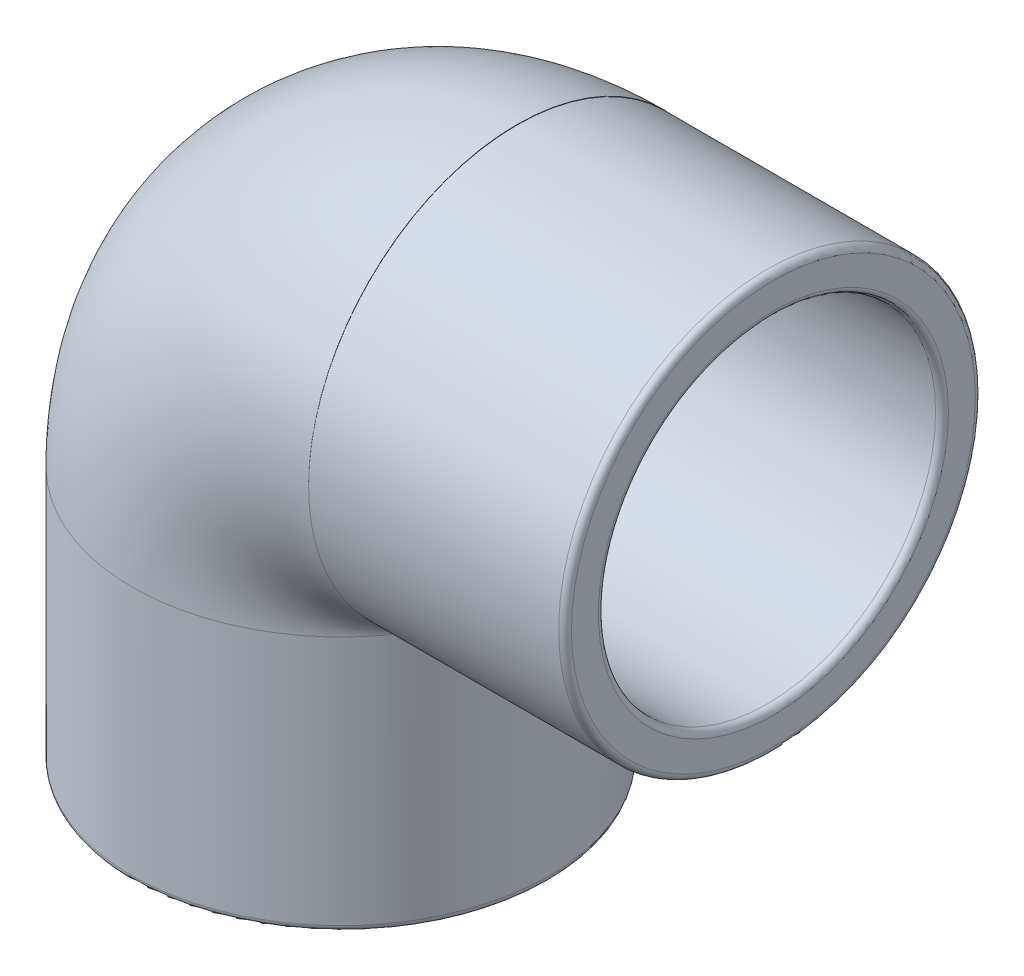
ISO-10303-21;
HEADER;
FILE_DESCRIPTION(('STEP AP214'),'2;1');
FILE_NAME('part.step','',(''),(''),'','','');
FILE_SCHEMA(('AUTOMOTIVE_DESIGN { 1 0 10303 214 1 1 1 1 }'));
ENDSEC;
DATA;
#1=APPLICATION_CONTEXT('core data for automotive mechanical design processes');
#2=APPLICATION_PROTOCOL_DEFINITION('international standard','automotive_design',2000,#1);
#3=PRODUCT_CONTEXT('',#1,'mechanical');
#4=PRODUCT('Part','Part','',(#3));
#5=PRODUCT_RELATED_PRODUCT_CATEGORY('part','',(#4));
#6=PRODUCT_DEFINITION_FORMATION('','',#4);
#7=PRODUCT_DEFINITION_CONTEXT('part definition',#1,'design');
#8=PRODUCT_DEFINITION('design','',#6,#7);
#9=PRODUCT_DEFINITION_SHAPE('','',#8);
#10=(LENGTH_UNIT() NAMED_UNIT(*) SI_UNIT(.MILLI.,.METRE.));
#11=(NAMED_UNIT(*) PLANE_ANGLE_UNIT() SI_UNIT($,.RADIAN.));
#12=(NAMED_UNIT(*) SI_UNIT($,.STERADIAN.) SOLID_ANGLE_UNIT());
#13=UNCERTAINTY_MEASURE_WITH_UNIT(LENGTH_MEASURE(1.E-05),#10,'distance_accuracy_value','');
#14=(GEOMETRIC_REPRESENTATION_CONTEXT(3) GLOBAL_UNCERTAINTY_ASSIGNED_CONTEXT((#13)) GLOBAL_UNIT_ASSIGNED_CONTEXT((#10,
#11,#12)) REPRESENTATION_CONTEXT('',''));
#15=CARTESIAN_POINT('',(0.,0.,0.));
#16=DIRECTION('',(0.,0.,1.));
#17=DIRECTION('',(1.,0.,0.));
#18=AXIS2_PLACEMENT_3D('',#15,#16,#17);
#19=CARTESIAN_POINT('',(0.,17.4254660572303,0.));
#20=DIRECTION('',(1.,0.,0.));
#21=DIRECTION('',(0.,0.,-1.));
#22=AXIS2_PLACEMENT_3D('',#19,#20,#21);
#23=PLANE('',#22);
#24=CARTESIAN_POINT('',(0.,17.4635017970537,0.));
#25=DIRECTION('',(1.,0.,0.));
#26=DIRECTION('',(0.,1.,0.));
#27=AXIS2_PLACEMENT_3D('',#24,#25,#26);
#28=CIRCLE('',#27,20.6375);
#29=CARTESIAN_POINT('',(0.,17.4444839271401,20.637491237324));
#30=VERTEX_POINT('',#29);
#31=CARTESIAN_POINT('',(0.,0.,10.9969319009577));
#32=VERTEX_POINT('',#31);
#33=EDGE_CURVE('E82',#30,#32,#28,.T.);
#34=ORIENTED_EDGE('',*,*,#33,.T.);
#35=DIRECTION('',(0.,-1.,0.));
#36=VECTOR('',#35,1.);
#37=CARTESIAN_POINT('',(0.,0.,10.9969319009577));
#38=LINE('',#37,#36);
#39=CARTESIAN_POINT('',(0.,-0.0380357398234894,10.9969319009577));
#40=VERTEX_POINT('',#39);
#41=EDGE_CURVE('E94',#32,#40,#38,.T.);
#42=ORIENTED_EDGE('',*,*,#41,.T.);
#43=CARTESIAN_POINT('',(0.,17.4254660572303,0.));
#44=DIRECTION('',(1.,0.,0.));
#45=DIRECTION('',(0.,0.,-1.));
#46=AXIS2_PLACEMENT_3D('',#43,#44,#45);
#47=CIRCLE('',#46,20.6375);
#48=EDGE_CURVE('E63',#30,#40,#47,.T.);
#49=ORIENTED_EDGE('',*,*,#48,.F.);
#50=EDGE_LOOP('',(#34,#42,#49));
#51=FACE_BOUND('',#50,.T.);
#52=ADVANCED_FACE('F42',(#51),#23,.F.);
#53=CARTESIAN_POINT('',(0.,0.,-10.9969319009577));
#54=VERTEX_POINT('',#53);
#55=CARTESIAN_POINT('',(0.,17.4444839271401,-20.637491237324));
#56=VERTEX_POINT('',#55);
#57=EDGE_CURVE('E85',#54,#56,#28,.T.);
#58=ORIENTED_EDGE('',*,*,#57,.T.);
#59=CARTESIAN_POINT('',(0.,-0.0380357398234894,-10.9969319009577));
#60=VERTEX_POINT('',#59);
#61=EDGE_CURVE('E109',#60,#56,#47,.T.);
#62=ORIENTED_EDGE('',*,*,#61,.F.);
#63=DIRECTION('',(0.,-1.,0.));
#64=VECTOR('',#63,1.);
#65=CARTESIAN_POINT('',(0.,0.,-10.9969319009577));
#66=LINE('',#65,#64);
#67=EDGE_CURVE('E102',#60,#54,#66,.F.);
#68=ORIENTED_EDGE('',*,*,#67,.T.);
#69=EDGE_LOOP('',(#58,#62,#68));
#70=FACE_BOUND('',#69,.T.);
#71=ADVANCED_FACE('F157',(#70),#23,.F.);
#72=CARTESIAN_POINT('',(0.,17.4254660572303,0.));
#73=DIRECTION('',(1.,0.,0.));
#74=DIRECTION('',(0.,0.,-1.));
#75=AXIS2_PLACEMENT_3D('',#72,#73,#74);
#76=CYLINDRICAL_SURFACE('',#75,20.6375);
#77=CARTESIAN_POINT('',(24.765,17.4254660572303,0.));
#78=DIRECTION('',(1.,0.,0.));
#79=DIRECTION('',(0.,0.,-1.));
#80=AXIS2_PLACEMENT_3D('',#77,#78,#79);
#81=CIRCLE('',#80,20.6375);
#82=CARTESIAN_POINT('',(24.765,17.4254660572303,-20.6375));
#83=VERTEX_POINT('',#82);
#84=EDGE_CURVE('E11',#83,#83,#81,.F.);
#85=ORIENTED_EDGE('',*,*,#84,.T.);
#86=EDGE_LOOP('',(#85));
#87=FACE_BOUND('',#86,.T.);
#88=CARTESIAN_POINT('',(-17.4635017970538,17.4254660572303,0.));
#89=DIRECTION('',(0.707106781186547,0.707106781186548,0.));
#90=DIRECTION('',(0.707106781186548,-0.707106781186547,0.));
#91=AXIS2_PLACEMENT_3D('',#88,#89,#90);
#92=ELLIPSE('',#91,29.1858323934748,20.6375);
#93=EDGE_CURVE('E58',#60,#40,#92,.F.);
#94=ORIENTED_EDGE('',*,*,#93,.F.);
#95=ORIENTED_EDGE('',*,*,#61,.T.);
#96=CARTESIAN_POINT('',(0.,17.4254660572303,0.));
#97=DIRECTION('',(1.,0.,0.));
#98=DIRECTION('',(0.,1.,0.));
#99=AXIS2_PLACEMENT_3D('',#96,#97,#98);
#100=CIRCLE('',#99,20.6375);
#101=EDGE_CURVE('E91',#30,#56,#100,.F.);
#102=ORIENTED_EDGE('',*,*,#101,.F.);
#103=ORIENTED_EDGE('',*,*,#48,.T.);
#104=EDGE_LOOP('',(#94,#95,#102,#103));
#105=FACE_BOUND('',#104,.T.);
#106=ADVANCED_FACE('F162',(#87,#105),#76,.T.);
#107=CARTESIAN_POINT('',(25.4,17.4254660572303,0.));
#108=DIRECTION('',(1.,0.,0.));
#109=DIRECTION('',(0.,0.,-1.));
#110=AXIS2_PLACEMENT_3D('',#107,#108,#109);
#111=PLANE('',#110);
#112=CARTESIAN_POINT('',(25.4,17.4635017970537,0.));
#113=DIRECTION('',(1.,0.,0.));
#114=DIRECTION('',(0.,0.,-1.));
#115=AXIS2_PLACEMENT_3D('',#112,#113,#114);
#116=CIRCLE('',#115,17.3355);
#117=CARTESIAN_POINT('',(25.4,17.4635017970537,-17.3355));
#118=VERTEX_POINT('',#117);
#119=EDGE_CURVE('E128',#118,#118,#116,.F.);
#120=ORIENTED_EDGE('',*,*,#119,.T.);
#121=EDGE_LOOP('',(#120));
#122=FACE_BOUND('',#121,.T.);
#123=CARTESIAN_POINT('',(25.4,17.4254660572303,0.));
#124=DIRECTION('',(1.,0.,0.));
#125=DIRECTION('',(0.,0.,-1.));
#126=AXIS2_PLACEMENT_3D('',#123,#124,#125);
#127=CIRCLE('',#126,20.0025);
#128=CARTESIAN_POINT('',(25.4,17.4254660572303,-20.0025));
#129=VERTEX_POINT('',#128);
#130=EDGE_CURVE('E124',#129,#129,#127,.T.);
#131=ORIENTED_EDGE('',*,*,#130,.T.);
#132=EDGE_LOOP('',(#131));
#133=FACE_BOUND('',#132,.T.);
#134=ADVANCED_FACE('F154',(#122,#133),#111,.T.);
#135=CARTESIAN_POINT('',(-17.4635017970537,0.,0.));
#136=DIRECTION('',(0.,-1.,0.));
#137=DIRECTION('',(1.,0.,0.));
#138=AXIS2_PLACEMENT_3D('',#135,#136,#137);
#139=CYLINDRICAL_SURFACE('',#138,20.6375);
#140=CARTESIAN_POINT('',(-17.4635017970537,-24.765,0.));
#141=DIRECTION('',(0.,-1.,0.));
#142=DIRECTION('',(1.,0.,0.));
#143=AXIS2_PLACEMENT_3D('',#140,#141,#142);
#144=CIRCLE('',#143,20.6375);
#145=CARTESIAN_POINT('',(3.17399820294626,-24.765,0.));
#146=VERTEX_POINT('',#145);
#147=EDGE_CURVE('E51',#146,#146,#144,.F.);
#148=ORIENTED_EDGE('',*,*,#147,.T.);
#149=EDGE_LOOP('',(#148));
#150=FACE_BOUND('',#149,.T.);
#151=ORIENTED_EDGE('',*,*,#41,.F.);
#152=CARTESIAN_POINT('',(-17.4635017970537,0.,0.));
#153=DIRECTION('',(0.,-1.,0.));
#154=DIRECTION('',(1.,0.,0.));
#155=AXIS2_PLACEMENT_3D('',#152,#153,#154);
#156=CIRCLE('',#155,20.6375);
#157=EDGE_CURVE('E78',#32,#54,#156,.T.);
#158=ORIENTED_EDGE('',*,*,#157,.T.);
#159=ORIENTED_EDGE('',*,*,#67,.F.);
#160=ORIENTED_EDGE('',*,*,#93,.T.);
#161=EDGE_LOOP('',(#151,#158,#159,#160));
#162=FACE_BOUND('',#161,.T.);
#163=ADVANCED_FACE('F99',(#150,#162),#139,.T.);
#164=CARTESIAN_POINT('',(-17.4635017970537,-25.4,0.));
#165=DIRECTION('',(0.,-1.,0.));
#166=DIRECTION('',(1.,0.,0.));
#167=AXIS2_PLACEMENT_3D('',#164,#165,#166);
#168=PLANE('',#167);
#169=CARTESIAN_POINT('',(-17.4635017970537,-25.4,0.));
#170=DIRECTION('',(0.,-1.,0.));
#171=DIRECTION('',(1.,0.,0.));
#172=AXIS2_PLACEMENT_3D('',#169,#170,#171);
#173=CIRCLE('',#172,17.3355);
#174=CARTESIAN_POINT('',(-0.128001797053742,-25.4,0.));
#175=VERTEX_POINT('',#174);
#176=EDGE_CURVE('E116',#175,#175,#173,.F.);
#177=ORIENTED_EDGE('',*,*,#176,.T.);
#178=EDGE_LOOP('',(#177));
#179=FACE_BOUND('',#178,.T.);
#180=CARTESIAN_POINT('',(-17.4635017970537,-25.4,0.));
#181=DIRECTION('',(0.,-1.,0.));
#182=DIRECTION('',(1.,0.,0.));
#183=AXIS2_PLACEMENT_3D('',#180,#181,#182);
#184=CIRCLE('',#183,20.0025);
#185=CARTESIAN_POINT('',(2.53899820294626,-25.4,0.));
#186=VERTEX_POINT('',#185);
#187=EDGE_CURVE('E107',#186,#186,#184,.T.);
#188=ORIENTED_EDGE('',*,*,#187,.T.);
#189=EDGE_LOOP('',(#188));
#190=FACE_BOUND('',#189,.T.);
#191=ADVANCED_FACE('F142',(#179,#190),#168,.T.);
#192=CARTESIAN_POINT('',(0.,0.,0.));
#193=DIRECTION('',(0.,0.,1.));
#194=DIRECTION('',(1.,0.,0.));
#195=AXIS2_PLACEMENT_3D('',#192,#193,#194);
#196=TOROIDAL_SURFACE('',#195,17.4635017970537,16.0655);
#197=CARTESIAN_POINT('',(0.,17.4635017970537,0.));
#198=DIRECTION('',(1.,0.,0.));
#199=DIRECTION('',(0.,1.,0.));
#200=AXIS2_PLACEMENT_3D('',#197,#198,#199);
#201=CIRCLE('',#200,16.0655);
#202=CARTESIAN_POINT('',(1.12486339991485E-13,33.5290017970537,0.));
#203=VERTEX_POINT('',#202);
#204=EDGE_CURVE('E203',#203,#203,#201,.F.);
#205=CARTESIAN_POINT('',(-17.4635017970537,0.,0.));
#206=DIRECTION('',(0.,-1.,0.));
#207=DIRECTION('',(1.,0.,0.));
#208=AXIS2_PLACEMENT_3D('',#205,#206,#207);
#209=CIRCLE('',#208,16.0655);
#210=CARTESIAN_POINT('',(-33.5290017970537,0.,0.));
#211=VERTEX_POINT('',#210);
#212=EDGE_CURVE('E194',#211,#211,#209,.F.);
#213=CARTESIAN_POINT('',(0.,0.,0.));
#214=DIRECTION('',(0.,0.,1.));
#215=DIRECTION('',(1.,0.,0.));
#216=AXIS2_PLACEMENT_3D('',#213,#214,#215);
#217=CIRCLE('',#216,33.5290017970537);
#218=EDGE_CURVE('',#203,#211,#217,.T.);
#219=ORIENTED_EDGE('',*,*,#204,.F.);
#220=ORIENTED_EDGE('',*,*,#212,.F.);
#221=ORIENTED_EDGE('',*,*,#218,.T.);
#222=ORIENTED_EDGE('',*,*,#218,.F.);
#223=EDGE_LOOP('',(#219,#221,#220,#222));
#224=FACE_BOUND('',#223,.T.);
#225=ADVANCED_FACE('F144',(#224),#196,.F.);
#226=CARTESIAN_POINT('',(0.,0.,0.));
#227=DIRECTION('',(1.,0.,0.));
#228=DIRECTION('',(0.,1.,0.));
#229=AXIS2_PLACEMENT_3D('',#226,#227,#228);
#230=PLANE('',#229);
#231=ORIENTED_EDGE('',*,*,#204,.T.);
#232=EDGE_LOOP('',(#231));
#233=FACE_BOUND('',#232,.T.);
#234=CARTESIAN_POINT('',(0.,17.4635017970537,0.));
#235=DIRECTION('',(1.,0.,0.));
#236=DIRECTION('',(0.,0.,-1.));
#237=AXIS2_PLACEMENT_3D('',#234,#235,#236);
#238=CIRCLE('',#237,16.7005);
#239=CARTESIAN_POINT('',(0.,17.4635017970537,-16.7005));
#240=VERTEX_POINT('',#239);
#241=EDGE_CURVE('E97',#240,#240,#238,.T.);
#242=ORIENTED_EDGE('',*,*,#241,.T.);
#243=EDGE_LOOP('',(#242));
#244=FACE_BOUND('',#243,.T.);
#245=ADVANCED_FACE('F151',(#233,#244),#230,.T.);
#246=CARTESIAN_POINT('',(17.4635017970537,0.,0.));
#247=DIRECTION('',(0.,-1.,0.));
#248=DIRECTION('',(1.,0.,0.));
#249=AXIS2_PLACEMENT_3D('',#246,#247,#248);
#250=CIRCLE('',#249,20.6375);
#251=TRIMMED_CURVE('',#250,(PARAMETER_VALUE(-2.57961394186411)),
(PARAMETER_VALUE(2.57961394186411)),.T.,.PARAMETER.);
#252=CARTESIAN_POINT('',(0.,0.,0.));
#253=DIRECTION('',(0.,0.,1.));
#254=AXIS1_PLACEMENT('',#252,#253);
#255=SURFACE_OF_REVOLUTION('',#251,#254);
#256=ORIENTED_EDGE('',*,*,#57,.F.);
#257=ORIENTED_EDGE('',*,*,#157,.F.);
#258=ORIENTED_EDGE('',*,*,#33,.F.);
#259=EDGE_CURVE('E96',#56,#30,#28,.T.);
#260=ORIENTED_EDGE('',*,*,#259,.F.);
#261=EDGE_LOOP('',(#256,#257,#258,#260));
#262=FACE_BOUND('',#261,.T.);
#263=ADVANCED_FACE('F80',(#262),#255,.T.);
#264=ORIENTED_EDGE('',*,*,#259,.T.);
#265=ORIENTED_EDGE('',*,*,#101,.T.);
#266=EDGE_LOOP('',(#264,#265));
#267=FACE_BOUND('',#266,.T.);
#268=ADVANCED_FACE('F188',(#267),#230,.T.);
#269=CARTESIAN_POINT('',(0.,17.4635017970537,0.));
#270=DIRECTION('',(1.,0.,0.));
#271=DIRECTION('',(0.,0.,-1.));
#272=AXIS2_PLACEMENT_3D('',#269,#270,#271);
#273=CYLINDRICAL_SURFACE('',#272,16.7005);
#274=CARTESIAN_POINT('',(24.765,17.4635017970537,0.));
#275=DIRECTION('',(1.,0.,0.));
#276=DIRECTION('',(0.,0.,-1.));
#277=AXIS2_PLACEMENT_3D('',#274,#275,#276);
#278=CIRCLE('',#277,16.7005);
#279=CARTESIAN_POINT('',(24.765,17.4635017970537,-16.7005));
#280=VERTEX_POINT('',#279);
#281=EDGE_CURVE('E120',#280,#280,#278,.T.);
#282=ORIENTED_EDGE('',*,*,#281,.T.);
#283=EDGE_LOOP('',(#282));
#284=FACE_BOUND('',#283,.T.);
#285=ORIENTED_EDGE('',*,*,#241,.F.);
#286=EDGE_LOOP('',(#285));
#287=FACE_BOUND('',#286,.T.);
#288=ADVANCED_FACE('F184',(#284,#287),#273,.F.);
#289=CARTESIAN_POINT('',(-17.4635017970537,0.,0.));
#290=DIRECTION('',(0.,-1.,0.));
#291=DIRECTION('',(1.,0.,0.));
#292=AXIS2_PLACEMENT_3D('',#289,#290,#291);
#293=PLANE('',#292);
#294=CARTESIAN_POINT('',(-17.4635017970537,0.,0.));
#295=DIRECTION('',(0.,-1.,0.));
#296=DIRECTION('',(1.,0.,0.));
#297=AXIS2_PLACEMENT_3D('',#294,#295,#296);
#298=CIRCLE('',#297,16.7005);
#299=CARTESIAN_POINT('',(-0.763001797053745,0.,0.));
#300=VERTEX_POINT('',#299);
#301=EDGE_CURVE('E198',#300,#300,#298,.T.);
#302=ORIENTED_EDGE('',*,*,#301,.T.);
#303=EDGE_LOOP('',(#302));
#304=FACE_BOUND('',#303,.T.);
#305=ORIENTED_EDGE('',*,*,#212,.T.);
#306=EDGE_LOOP('',(#305));
#307=FACE_BOUND('',#306,.T.);
#308=ADVANCED_FACE('F187',(#304,#307),#293,.T.);
#309=CARTESIAN_POINT('',(-17.4635017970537,0.,0.));
#310=DIRECTION('',(0.,-1.,0.));
#311=DIRECTION('',(1.,0.,0.));
#312=AXIS2_PLACEMENT_3D('',#309,#310,#311);
#313=CYLINDRICAL_SURFACE('',#312,16.7005);
#314=CARTESIAN_POINT('',(-17.4635017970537,-24.765,0.));
#315=DIRECTION('',(0.,-1.,0.));
#316=DIRECTION('',(1.,0.,0.));
#317=AXIS2_PLACEMENT_3D('',#314,#315,#316);
#318=CIRCLE('',#317,16.7005);
#319=CARTESIAN_POINT('',(-0.763001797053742,-24.765,0.));
#320=VERTEX_POINT('',#319);
#321=EDGE_CURVE('E101',#320,#320,#318,.T.);
#322=ORIENTED_EDGE('',*,*,#321,.T.);
#323=EDGE_LOOP('',(#322));
#324=FACE_BOUND('',#323,.T.);
#325=ORIENTED_EDGE('',*,*,#301,.F.);
#326=EDGE_LOOP('',(#325));
#327=FACE_BOUND('',#326,.T.);
#328=ADVANCED_FACE('F174',(#324,#327),#313,.F.);
#329=CARTESIAN_POINT('',(-17.4635017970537,-24.765,0.));
#330=DIRECTION('',(0.,-1.,0.));
#331=DIRECTION('',(1.,0.,0.));
#332=AXIS2_PLACEMENT_3D('',#329,#330,#331);
#333=TOROIDAL_SURFACE('',#332,17.3355,0.635);
#334=ORIENTED_EDGE('',*,*,#176,.F.);
#335=EDGE_LOOP('',(#334));
#336=FACE_BOUND('',#335,.T.);
#337=ORIENTED_EDGE('',*,*,#321,.F.);
#338=EDGE_LOOP('',(#337));
#339=FACE_BOUND('',#338,.T.);
#340=ADVANCED_FACE('F171',(#336,#339),#333,.T.);
#341=CARTESIAN_POINT('',(24.765,17.4635017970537,0.));
#342=DIRECTION('',(1.,0.,0.));
#343=DIRECTION('',(0.,0.,-1.));
#344=AXIS2_PLACEMENT_3D('',#341,#342,#343);
#345=TOROIDAL_SURFACE('',#344,17.3355,0.635);
#346=ORIENTED_EDGE('',*,*,#119,.F.);
#347=EDGE_LOOP('',(#346));
#348=FACE_BOUND('',#347,.T.);
#349=ORIENTED_EDGE('',*,*,#281,.F.);
#350=EDGE_LOOP('',(#349));
#351=FACE_BOUND('',#350,.T.);
#352=ADVANCED_FACE('F139',(#348,#351),#345,.T.);
#353=CARTESIAN_POINT('',(-17.4635017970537,-24.765,0.));
#354=DIRECTION('',(0.,-1.,0.));
#355=DIRECTION('',(1.,0.,0.));
#356=AXIS2_PLACEMENT_3D('',#353,#354,#355);
#357=TOROIDAL_SURFACE('',#356,20.0025,0.635);
#358=ORIENTED_EDGE('',*,*,#147,.F.);
#359=EDGE_LOOP('',(#358));
#360=FACE_BOUND('',#359,.T.);
#361=ORIENTED_EDGE('',*,*,#187,.F.);
#362=EDGE_LOOP('',(#361));
#363=FACE_BOUND('',#362,.T.);
#364=ADVANCED_FACE('F136',(#360,#363),#357,.T.);
#365=CARTESIAN_POINT('',(24.765,17.4254660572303,0.));
#366=DIRECTION('',(1.,0.,0.));
#367=DIRECTION('',(0.,0.,-1.));
#368=AXIS2_PLACEMENT_3D('',#365,#366,#367);
#369=TOROIDAL_SURFACE('',#368,20.0025,0.635);
#370=ORIENTED_EDGE('',*,*,#84,.F.);
#371=EDGE_LOOP('',(#370));
#372=FACE_BOUND('',#371,.T.);
#373=ORIENTED_EDGE('',*,*,#130,.F.);
#374=EDGE_LOOP('',(#373));
#375=FACE_BOUND('',#374,.T.);
#376=ADVANCED_FACE('F44',(#372,#375),#369,.T.);
#377=CLOSED_SHELL('',(#52,#71,#106,#134,#163,#191,#225,#245,#263,#268,#288,#308,#328,#340,#352,
#364,#376));
#378=MANIFOLD_SOLID_BREP('B2',#377);
#379=ADVANCED_BREP_SHAPE_REPRESENTATION('',(#18,#378),#14);
#380=SHAPE_DEFINITION_REPRESENTATION(#9,#379);
ENDSEC;
END-ISO-10303-21;
